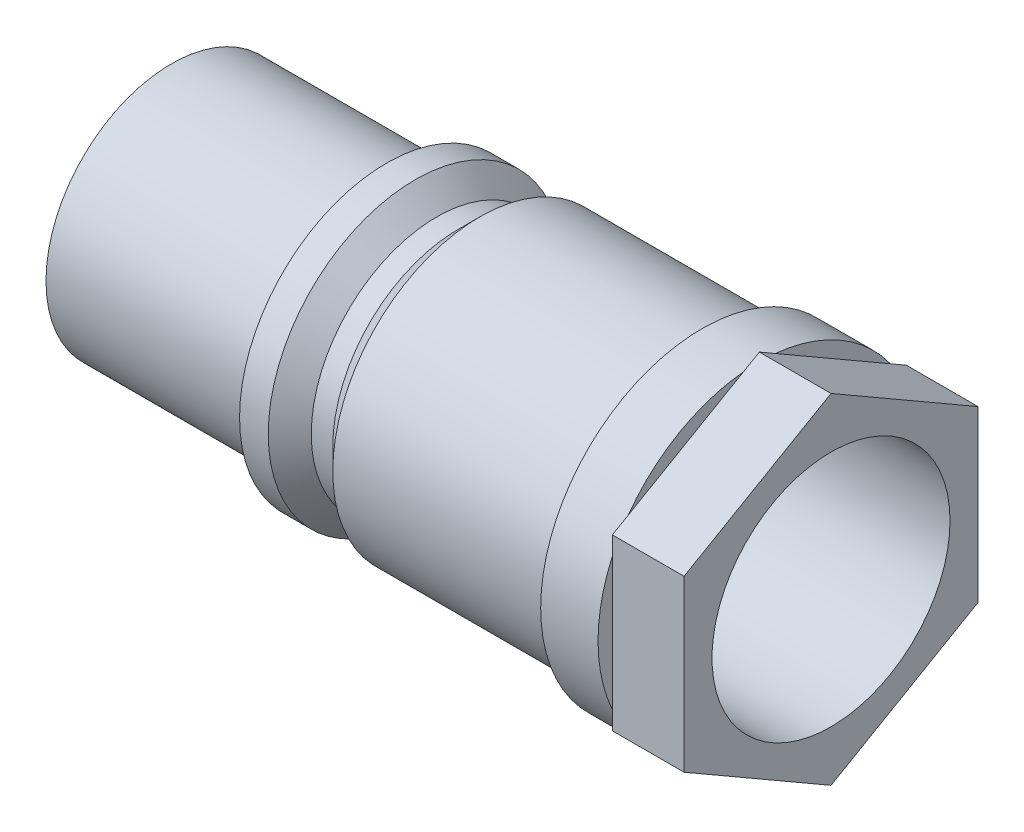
from build123d import *

# Parameters (mm, degrees)
SALIENTE_EXTRUIR1_DEPTH = 10
CROQUIS3_R              = 16.6
CORTAR_EXTRUIR1_DEPTH   = 98.624706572


with BuildPart() as part:
    # Croquis1 → Revoluci_n1 (revolve)
    with BuildSketch(Plane.XY, mode=Mode.PRIVATE) as revoluci_n1_sk:
        Polygon((0, 0), (0, 17.5), (30, 17.5), (30, 20.5), (34, 20.5), (37, 17.5), (40, 17.5), (43, 20.5), (74, 20.5), (74, 22.5), (82, 22.5), (82, 0), align=None)
    revolve(revoluci_n1_sk.sketch.rotate(Axis((0, 0, 0), (1, 0, 0)), 90), axis=Axis((0, 0, 0), (1, 0, 0)))

    # Croquis2 → Saliente-Extruir1 (add)
    with BuildSketch(Plane(origin=(82, 0, 0), x_dir=(0, 0, -1), z_dir=(1, 0, 0))):
        Polygon((0, 23.671361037), (-20.5, 11.835680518), (-20.5, -11.835680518), (0, -23.671361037), (20.5, -11.835680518), (20.5, 11.835680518), align=None)
    extrude(amount=SALIENTE_EXTRUIR1_DEPTH)

    # Croquis3 → Cortar-Extruir1 (cut, through all)
    with BuildSketch(Plane(origin=(92, 0, 0), x_dir=(0, 0, -1), z_dir=(1, 0, 0))):
        Circle(CROQUIS3_R)
    extrude(amount=-CORTAR_EXTRUIR1_DEPTH, mode=Mode.SUBTRACT)


solid = part.part
